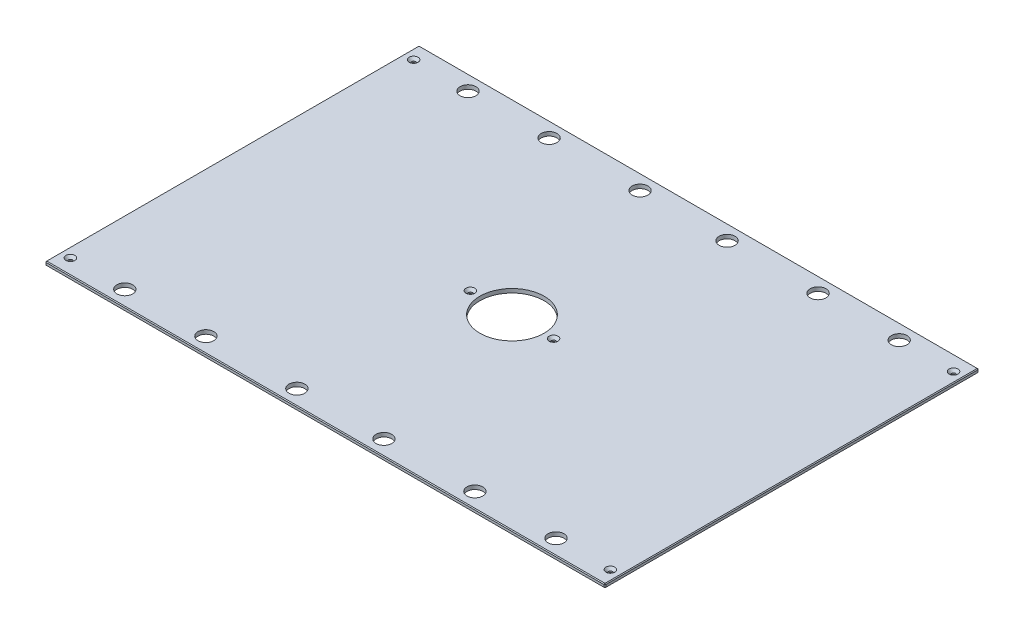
from build123d import *

# Parameters (mm, degrees)
SKETCH1_W                                     = 898.525
SKETCH1_H                                     = 600.075
BOSS_EXTRUDE1_DEPTH                           = 6.35
SKETCH13_R                                    = 51.562
CUT_EXTRUDE6_DEPTH                            = 541.277352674
F_1_1_DIAMETER_HOLE1_D                        = 25.4
CHAMFER2_SIZE                                 = 1.27
CSK_FOR_1_4_FLAT_HEAD_MACHINE_SCREW1_AT_COUNT = 2
CSK_FOR_1_4_FLAT_HEAD_MACHINE_SCREW1_AT_PITCH = 550.85996
CSK_FOR_1_4_FLAT_HEAD_MACHINE_SCREW1_2_COUNT  = 2
CSK_FOR_1_4_FLAT_HEAD_MACHINE_SCREW1_2_PITCH  = 1027.008079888
CSK_FOR_1_4_FLAT_HEAD_MACHINE_SCREW1_3_COUNT  = 2
CSK_FOR_1_4_FLAT_HEAD_MACHINE_SCREW1_3_PITCH  = 570.897694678
CSK_FOR_1_4_FLAT_HEAD_MACHINE_SCREW1_4_COUNT  = 2
CSK_FOR_1_4_FLAT_HEAD_MACHINE_SCREW1_4_PITCH  = 458.628097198
CSK_FOR_1_4_FLAT_HEAD_MACHINE_SCREW1_5_COUNT  = 2
CSK_FOR_1_4_FLAT_HEAD_MACHINE_SCREW1_5_PITCH  = 866.775
CSK_FOR_1_4_FLAT_HEAD_MACHINE_SCREW1_6_COUNT  = 2
CSK_FOR_1_4_FLAT_HEAD_MACHINE_SCREW1_6_PITCH  = 779.4625
CSK_FOR_1_4_FLAT_HEAD_MACHINE_SCREW1_7_COUNT  = 2
CSK_FOR_1_4_FLAT_HEAD_MACHINE_SCREW1_7_PITCH  = 954.467644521


with BuildPart() as part:
    # Sketch1 → Boss-Extrude1 (new body)
    with BuildSketch(Plane(origin=(0, 0, 0), x_dir=(1, 0, 0), z_dir=(0, 1, 0))):
        Rectangle(SKETCH1_W, SKETCH1_H)
    extrude(amount=BOSS_EXTRUDE1_DEPTH)

    # Sketch13 → Cut-Extrude6 (cut, through all)
    with BuildSketch(Plane(origin=(0, 6.35, 0), x_dir=(1, 0, 0), z_dir=(0, 1, 0))):
        with Locations(Location((0, 0, 0), (0, 0, 270))):
            Circle(SKETCH13_R)
    extrude(amount=-CUT_EXTRUDE6_DEPTH, mode=Mode.SUBTRACT)

    # 1 _1_ Diameter Hole1 (through all)
    with Locations(Plane(origin=(0, 6.35, 0), x_dir=(1, 0, 0), z_dir=(0, 1, 0))):
        with Locations((346.075, 275.42998), (-346.075, 275.42998), (346.075, -275.42998), (-346.075, -275.42998), (-215.9, 275.42998), (215.9, 275.42998), (215.9, -275.42998), (-215.9, -275.42998), (69.85, 275.42998), (-69.85, 275.42998), (-69.85, -275.42998), (69.85, -275.42998)):
            Hole(F_1_1_DIAMETER_HOLE1_D / 2)

    # Chamfer2
    chamfer2_edges = [part.edges().sort_by_distance(p)[0] for p in [
        (449.2625, 6.35, 0),
        (0, 6.35, -300.0375),
        (-449.2625, 6.35, 0),
        (0, 0, -300.0375),
        (449.2625, 0, 0),
        (0, 0, 300.0375),
        (-449.2625, 0, 0),
        (0, 6.35, 300.0375),
        (-449.2625, 3.175, -300.0375),
        (449.2625, 3.175, -300.0375),
        (449.2625, 3.175, 300.0375),
        (-449.2625, 3.175, 300.0375),
    ]]
    chamfer(chamfer2_edges, length=CHAMFER2_SIZE)

    # Sketch24 → CSK for 1_4 Flat Head Machine Screw1 (revolve, cut)
    with BuildSketch(Plane(origin=(433.3875, 6.35, -275.42998), x_dir=(0, 0, 1), z_dir=(1, 0, 0))):
        Polygon((0, 0), (0, 6.35), (3.3782, 6.35), (3.3782, 4.324464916), (7.1374, 0), align=None)
    csk_for_1_4_flat_head_machine_screw1 = revolve(axis=Axis((433.3875, 12.7, -275.42998), (0, -1, 0)), mode=Mode.SUBTRACT)

    # CSK for 1_4 Flat Head Machine Screw1 at: CSK for 1_4 Flat Head Machine Screw1 ×2
    with Locations(*[(0, 0, i * CSK_FOR_1_4_FLAT_HEAD_MACHINE_SCREW1_AT_PITCH) for i in range(1, CSK_FOR_1_4_FLAT_HEAD_MACHINE_SCREW1_AT_COUNT)]):
        add(csk_for_1_4_flat_head_machine_screw1, mode=Mode.SUBTRACT)

    # CSK for 1_4 Flat Head Machine Screw1 2: CSK for 1_4 Flat Head Machine Screw1 ×2
    with Locations(*[Vector(-0.8439807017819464, 0, 0.5363735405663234) * (i * CSK_FOR_1_4_FLAT_HEAD_MACHINE_SCREW1_2_PITCH) for i in range(1, CSK_FOR_1_4_FLAT_HEAD_MACHINE_SCREW1_2_COUNT)]):
        add(csk_for_1_4_flat_head_machine_screw1, mode=Mode.SUBTRACT)

    # CSK for 1_4 Flat Head Machine Screw1 3: CSK for 1_4 Flat Head Machine Screw1 ×2
    with Locations(*[Vector(-0.8759231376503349, 0, 0.4824506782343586) * (i * CSK_FOR_1_4_FLAT_HEAD_MACHINE_SCREW1_3_PITCH) for i in range(1, CSK_FOR_1_4_FLAT_HEAD_MACHINE_SCREW1_3_COUNT)]):
        add(csk_for_1_4_flat_head_machine_screw1, mode=Mode.SUBTRACT)

    # CSK for 1_4 Flat Head Machine Screw1 4: CSK for 1_4 Flat Head Machine Screw1 ×2
    with Locations(*[Vector(-0.7995857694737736, 0, 0.6005519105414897) * (i * CSK_FOR_1_4_FLAT_HEAD_MACHINE_SCREW1_4_PITCH) for i in range(1, CSK_FOR_1_4_FLAT_HEAD_MACHINE_SCREW1_4_COUNT)]):
        add(csk_for_1_4_flat_head_machine_screw1, mode=Mode.SUBTRACT)

    # CSK for 1_4 Flat Head Machine Screw1 5: CSK for 1_4 Flat Head Machine Screw1 ×2
    with Locations(*[(-i * CSK_FOR_1_4_FLAT_HEAD_MACHINE_SCREW1_5_PITCH, 0, 0) for i in range(1, CSK_FOR_1_4_FLAT_HEAD_MACHINE_SCREW1_5_COUNT)]):
        add(csk_for_1_4_flat_head_machine_screw1, mode=Mode.SUBTRACT)

    # CSK for 1_4 Flat Head Machine Screw1 6: CSK for 1_4 Flat Head Machine Screw1 ×2
    with Locations(*[(-i * CSK_FOR_1_4_FLAT_HEAD_MACHINE_SCREW1_6_PITCH, 0, 0) for i in range(1, CSK_FOR_1_4_FLAT_HEAD_MACHINE_SCREW1_6_COUNT)]):
        add(csk_for_1_4_flat_head_machine_screw1, mode=Mode.SUBTRACT)

    # CSK for 1_4 Flat Head Machine Screw1 7: CSK for 1_4 Flat Head Machine Screw1 ×2
    with Locations(*[Vector(-0.8166463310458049, 0, 0.5771384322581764) * (i * CSK_FOR_1_4_FLAT_HEAD_MACHINE_SCREW1_7_PITCH) for i in range(1, CSK_FOR_1_4_FLAT_HEAD_MACHINE_SCREW1_7_COUNT)]):
        add(csk_for_1_4_flat_head_machine_screw1, mode=Mode.SUBTRACT)


solid = part.part
